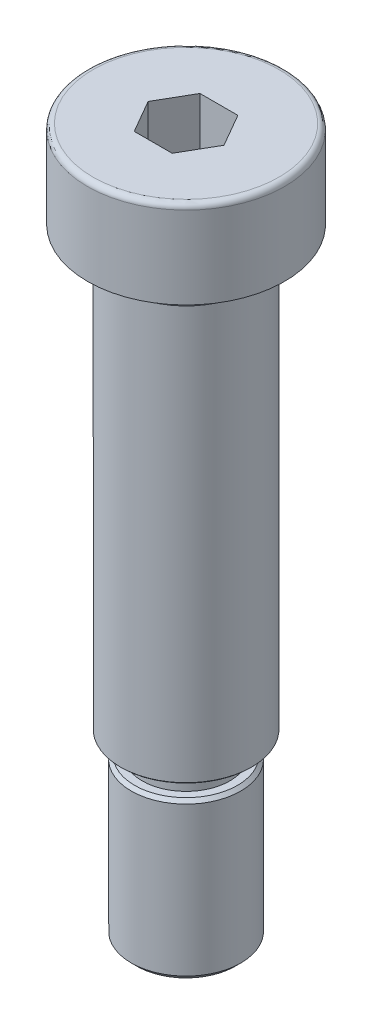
from build123d import *

# Parameters (mm, degrees)
ENL_V_MAT_EXTRU_1_DEPTH = 5
CHANFREIN1_SIZE         = 0.2
CONG_1_R                = 0.1
CHANFREIN2_SIZE         = 0.1
CONG_2_R                = 0.2
CHANFREIN3_SIZE         = 0.5
CHANFREIN4_SIZE         = 0.3


with BuildPart() as part:
    # Esquisse1 → Base-R_volution (revolve)
    with BuildSketch(Plane.XY, mode=Mode.PRIVATE) as base_r_volution_sk:
        with BuildLine():
            Line((0, 64.4), (-8.5, 64.4))
            ThreePointArc((-8.5, 64.4), (-8.853553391, 64.253553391), (-9, 63.9))
            Line((-9, 63.9), (-9, 56.4))
            Line((-9, 56.4), (-5, 56.4))
            Line((-5, 56.4), (-5, 54.4))
            Line((-5, 54.4), (-6, 54.4))
            Line((-6, 54.4), (-6, 16.4))
            Line((-6, 16.4), (-4, 16.4))
            Line((-4, 16.4), (-4, 14.4))
            Line((-4, 14.4), (-5, 14.4))
            Line((-5, 14.4), (-5, 0))
            Line((-5, 0), (0, 0))
            Line((0, 0), (0, 64.4))
        make_face()
    revolve(base_r_volution_sk.sketch.rotate(Axis((0, 50, 0), (0, -1, 0)), 270), axis=Axis((0, 50, 0), (0, -1, 0)))

    # Esquisse2 → Enl_v. mat.-Extru.1 (cut)
    with BuildSketch(Plane(origin=(0, 64.4, 0), x_dir=(-1, 0, 0), z_dir=(0, 1, 0))):
        Polygon((3.464101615, 0), (1.732050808, 3), (-1.732050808, 3), (-3.464101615, 0), (-1.732050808, -3), (1.732050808, -3), align=None)
    extrude(amount=-ENL_V_MAT_EXTRU_1_DEPTH, mode=Mode.SUBTRACT)

    # Chanfrein1
    chanfrein1_edges = [part.edges().sort_by_distance(p)[0] for p in [
        (0, 54.4, -6),
    ]]
    chamfer(chanfrein1_edges, length=CHANFREIN1_SIZE)

    # Cong_1
    cong_1_edges = [part.edges().sort_by_distance(p)[0] for p in [
        (0, 56.4, -5),
    ]]
    fillet(cong_1_edges, radius=CONG_1_R)

    # Chanfrein2
    chanfrein2_edges = [part.edges().sort_by_distance(p)[0] for p in [
        (0, 16.4, -6),
    ]]
    chamfer(chanfrein2_edges, length=CHANFREIN2_SIZE)

    # Cong_2
    cong_2_edges = [part.edges().sort_by_distance(p)[0] for p in [
        (0, 16.4, -4),
    ]]
    fillet(cong_2_edges, radius=CONG_2_R)

    # Chanfrein3
    chanfrein3_edges = [part.edges().sort_by_distance(p)[0] for p in [
        (0, 0, -5),
    ]]
    chamfer(chanfrein3_edges, length=CHANFREIN3_SIZE)

    # Chanfrein4
    chanfrein4_edges = [part.edges().sort_by_distance(p)[0] for p in [
        (0, 14.4, -5),
    ]]
    chamfer(chanfrein4_edges, length=CHANFREIN4_SIZE)


solid = part.part
